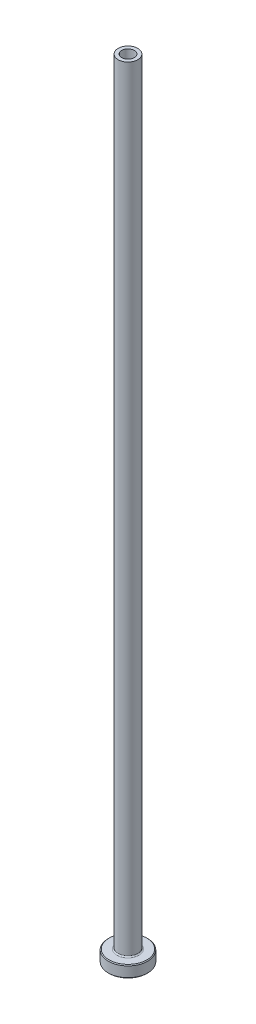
from build123d import *

# Parameters (mm, degrees)
FILLET1_R     = 0.3
CHAMFER1_SIZE = 0.2
CHAMFER3_SIZE = 0.5


with BuildPart() as part:
    # Sketch1 → Revolve1 (revolve)
    with BuildSketch(Plane.XY, mode=Mode.PRIVATE) as revolve1_sk:
        Polygon((-1.6, 200), (-2.5, 200), (-2.5, 3), (-5, 3), (-5, 0), (-1.85, 0), (-1.85, 143), (-1.6, 155), align=None)
    revolve(revolve1_sk.sketch.rotate(Axis((0, 92.187680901, 0), (0, -1, 0)), 270), axis=Axis((0, 92.187680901, 0), (0, -1, 0)))

    # Fillet1
    fillet1_edges = [part.edges().sort_by_distance(p)[0] for p in [
        (0, 3, -2.5),
    ]]
    fillet(fillet1_edges, radius=FILLET1_R)

    # Chamfer1
    chamfer1_edges = [part.edges().sort_by_distance(p)[0] for p in [
        (0, 0, -5),
        (0, 3, -5),
    ]]
    chamfer(chamfer1_edges, length=CHAMFER1_SIZE)

    # Chamfer3
    chamfer3_edges = [part.edges().sort_by_distance(p)[0] for p in [
        (0, 0, -1.85),
    ]]
    chamfer(chamfer3_edges, length=CHAMFER3_SIZE)


solid = part.part
